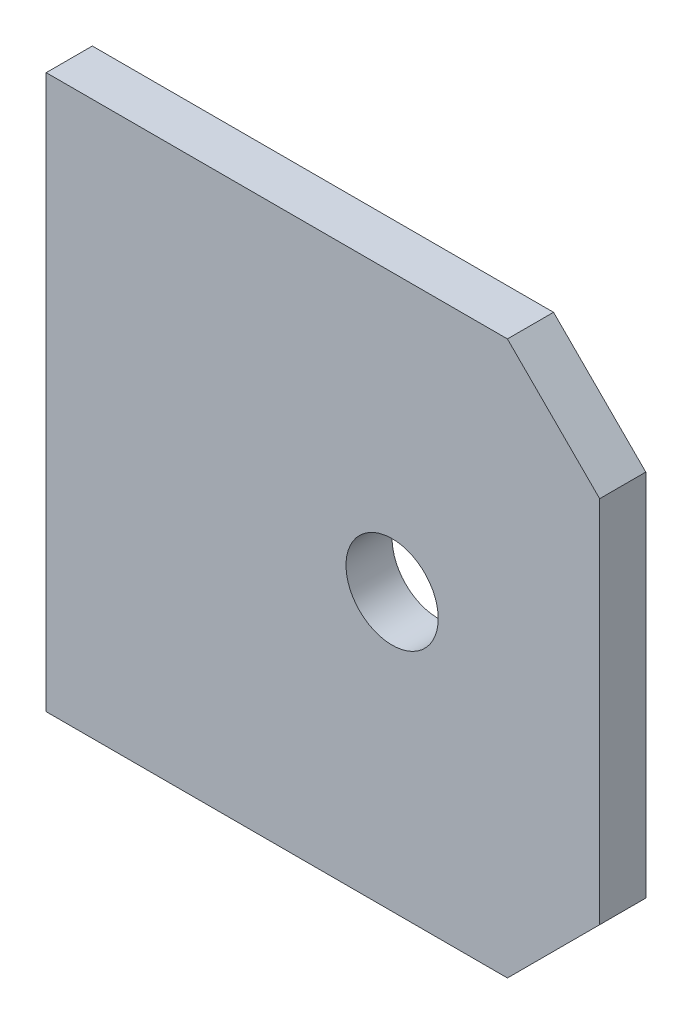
ISO-10303-21;
HEADER;
FILE_DESCRIPTION(('STEP AP214'),'2;1');
FILE_NAME('part.step','',(''),(''),'','','');
FILE_SCHEMA(('AUTOMOTIVE_DESIGN { 1 0 10303 214 1 1 1 1 }'));
ENDSEC;
DATA;
#1=APPLICATION_CONTEXT('core data for automotive mechanical design processes');
#2=APPLICATION_PROTOCOL_DEFINITION('international standard','automotive_design',2000,#1);
#3=PRODUCT_CONTEXT('',#1,'mechanical');
#4=PRODUCT('Part','Part','',(#3));
#5=PRODUCT_RELATED_PRODUCT_CATEGORY('part','',(#4));
#6=PRODUCT_DEFINITION_FORMATION('','',#4);
#7=PRODUCT_DEFINITION_CONTEXT('part definition',#1,'design');
#8=PRODUCT_DEFINITION('design','',#6,#7);
#9=PRODUCT_DEFINITION_SHAPE('','',#8);
#10=(LENGTH_UNIT() NAMED_UNIT(*) SI_UNIT(.MILLI.,.METRE.));
#11=(NAMED_UNIT(*) PLANE_ANGLE_UNIT() SI_UNIT($,.RADIAN.));
#12=(NAMED_UNIT(*) SI_UNIT($,.STERADIAN.) SOLID_ANGLE_UNIT());
#13=UNCERTAINTY_MEASURE_WITH_UNIT(LENGTH_MEASURE(1.E-05),#10,'distance_accuracy_value','');
#14=(GEOMETRIC_REPRESENTATION_CONTEXT(3) GLOBAL_UNCERTAINTY_ASSIGNED_CONTEXT((#13)) GLOBAL_UNIT_ASSIGNED_CONTEXT((#10,
#11,#12)) REPRESENTATION_CONTEXT('',''));
#15=CARTESIAN_POINT('',(0.,0.,0.));
#16=DIRECTION('',(0.,0.,1.));
#17=DIRECTION('',(1.,0.,0.));
#18=AXIS2_PLACEMENT_3D('',#15,#16,#17);
#19=CARTESIAN_POINT('',(0.,-120.,10.));
#20=DIRECTION('',(0.,0.,1.));
#21=DIRECTION('',(1.,0.,0.));
#22=AXIS2_PLACEMENT_3D('',#19,#20,#21);
#23=PLANE('',#22);
#24=DIRECTION('',(0.,-1.,0.));
#25=VECTOR('',#24,1.);
#26=CARTESIAN_POINT('',(0.,0.,10.));
#27=LINE('',#26,#25);
#28=CARTESIAN_POINT('',(0.,0.,10.));
#29=VERTEX_POINT('',#28);
#30=CARTESIAN_POINT('',(0.,-120.,10.));
#31=VERTEX_POINT('',#30);
#32=EDGE_CURVE('E117',#29,#31,#27,.T.);
#33=ORIENTED_EDGE('',*,*,#32,.T.);
#34=DIRECTION('',(1.,0.,0.));
#35=VECTOR('',#34,1.);
#36=CARTESIAN_POINT('',(0.,-120.,10.));
#37=LINE('',#36,#35);
#38=CARTESIAN_POINT('',(100.,-120.,10.));
#39=VERTEX_POINT('',#38);
#40=EDGE_CURVE('E98',#31,#39,#37,.T.);
#41=ORIENTED_EDGE('',*,*,#40,.T.);
#42=DIRECTION('',(0.707106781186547,0.707106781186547,0.));
#43=VECTOR('',#42,1.);
#44=CARTESIAN_POINT('',(120.,-100.,10.));
#45=LINE('',#44,#43);
#46=CARTESIAN_POINT('',(120.,-100.,10.));
#47=VERTEX_POINT('',#46);
#48=EDGE_CURVE('E120',#39,#47,#45,.T.);
#49=ORIENTED_EDGE('',*,*,#48,.T.);
#50=DIRECTION('',(0.,1.,0.));
#51=VECTOR('',#50,1.);
#52=CARTESIAN_POINT('',(120.,-20.,10.));
#53=LINE('',#52,#51);
#54=CARTESIAN_POINT('',(120.,-20.,10.));
#55=VERTEX_POINT('',#54);
#56=EDGE_CURVE('E122',#47,#55,#53,.T.);
#57=ORIENTED_EDGE('',*,*,#56,.T.);
#58=DIRECTION('',(-0.707106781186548,0.707106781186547,0.));
#59=VECTOR('',#58,1.);
#60=CARTESIAN_POINT('',(100.,0.,10.));
#61=LINE('',#60,#59);
#62=CARTESIAN_POINT('',(100.,0.,10.));
#63=VERTEX_POINT('',#62);
#64=EDGE_CURVE('E51',#55,#63,#61,.T.);
#65=ORIENTED_EDGE('',*,*,#64,.T.);
#66=DIRECTION('',(-1.,0.,0.));
#67=VECTOR('',#66,1.);
#68=CARTESIAN_POINT('',(0.,0.,10.));
#69=LINE('',#68,#67);
#70=EDGE_CURVE('E46',#63,#29,#69,.T.);
#71=ORIENTED_EDGE('',*,*,#70,.T.);
#72=EDGE_LOOP('',(#33,#41,#49,#57,#65,#71));
#73=FACE_BOUND('',#72,.T.);
#74=CARTESIAN_POINT('',(75.,-60.,10.));
#75=DIRECTION('',(0.,0.,1.));
#76=DIRECTION('',(1.,0.,0.));
#77=AXIS2_PLACEMENT_3D('',#74,#75,#76);
#78=CIRCLE('',#77,9.99999999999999);
#79=CARTESIAN_POINT('',(85.,-60.,10.));
#80=VERTEX_POINT('',#79);
#81=EDGE_CURVE('E103',#80,#80,#78,.T.);
#82=ORIENTED_EDGE('',*,*,#81,.F.);
#83=EDGE_LOOP('',(#82));
#84=FACE_BOUND('',#83,.T.);
#85=ADVANCED_FACE('F31',(#73,#84),#23,.T.);
#86=CARTESIAN_POINT('',(0.,-120.,0.));
#87=DIRECTION('',(0.,0.,1.));
#88=DIRECTION('',(1.,0.,0.));
#89=AXIS2_PLACEMENT_3D('',#86,#87,#88);
#90=PLANE('',#89);
#91=DIRECTION('',(0.,-1.,0.));
#92=VECTOR('',#91,1.);
#93=CARTESIAN_POINT('',(0.,0.,0.));
#94=LINE('',#93,#92);
#95=CARTESIAN_POINT('',(0.,0.,0.));
#96=VERTEX_POINT('',#95);
#97=CARTESIAN_POINT('',(0.,-120.,0.));
#98=VERTEX_POINT('',#97);
#99=EDGE_CURVE('E89',#96,#98,#94,.T.);
#100=ORIENTED_EDGE('',*,*,#99,.F.);
#101=DIRECTION('',(-1.,0.,0.));
#102=VECTOR('',#101,1.);
#103=CARTESIAN_POINT('',(0.,0.,0.));
#104=LINE('',#103,#102);
#105=CARTESIAN_POINT('',(100.,0.,0.));
#106=VERTEX_POINT('',#105);
#107=EDGE_CURVE('E115',#106,#96,#104,.T.);
#108=ORIENTED_EDGE('',*,*,#107,.F.);
#109=DIRECTION('',(-0.707106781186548,0.707106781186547,0.));
#110=VECTOR('',#109,1.);
#111=CARTESIAN_POINT('',(100.,0.,0.));
#112=LINE('',#111,#110);
#113=CARTESIAN_POINT('',(120.,-20.,0.));
#114=VERTEX_POINT('',#113);
#115=EDGE_CURVE('E113',#114,#106,#112,.T.);
#116=ORIENTED_EDGE('',*,*,#115,.F.);
#117=DIRECTION('',(0.,1.,0.));
#118=VECTOR('',#117,1.);
#119=CARTESIAN_POINT('',(120.,-20.,0.));
#120=LINE('',#119,#118);
#121=CARTESIAN_POINT('',(120.,-100.,0.));
#122=VERTEX_POINT('',#121);
#123=EDGE_CURVE('E111',#122,#114,#120,.T.);
#124=ORIENTED_EDGE('',*,*,#123,.F.);
#125=DIRECTION('',(0.707106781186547,0.707106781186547,0.));
#126=VECTOR('',#125,1.);
#127=CARTESIAN_POINT('',(120.,-100.,0.));
#128=LINE('',#127,#126);
#129=CARTESIAN_POINT('',(100.,-120.,0.));
#130=VERTEX_POINT('',#129);
#131=EDGE_CURVE('E91',#130,#122,#128,.T.);
#132=ORIENTED_EDGE('',*,*,#131,.F.);
#133=DIRECTION('',(1.,0.,0.));
#134=VECTOR('',#133,1.);
#135=CARTESIAN_POINT('',(0.,-120.,0.));
#136=LINE('',#135,#134);
#137=EDGE_CURVE('E84',#98,#130,#136,.T.);
#138=ORIENTED_EDGE('',*,*,#137,.F.);
#139=EDGE_LOOP('',(#100,#108,#116,#124,#132,#138));
#140=FACE_BOUND('',#139,.T.);
#141=CARTESIAN_POINT('',(75.,-60.,0.));
#142=DIRECTION('',(0.,0.,1.));
#143=DIRECTION('',(1.,0.,0.));
#144=AXIS2_PLACEMENT_3D('',#141,#142,#143);
#145=CIRCLE('',#144,9.99999999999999);
#146=CARTESIAN_POINT('',(85.,-60.,0.));
#147=VERTEX_POINT('',#146);
#148=EDGE_CURVE('E106',#147,#147,#145,.T.);
#149=ORIENTED_EDGE('',*,*,#148,.T.);
#150=EDGE_LOOP('',(#149));
#151=FACE_BOUND('',#150,.T.);
#152=ADVANCED_FACE('F85',(#140,#151),#90,.F.);
#153=CARTESIAN_POINT('',(0.,0.,10.));
#154=DIRECTION('',(1.,0.,0.));
#155=DIRECTION('',(0.,1.,0.));
#156=AXIS2_PLACEMENT_3D('',#153,#154,#155);
#157=PLANE('',#156);
#158=ORIENTED_EDGE('',*,*,#99,.T.);
#159=DIRECTION('',(0.,0.,-1.));
#160=VECTOR('',#159,1.);
#161=CARTESIAN_POINT('',(0.,-120.,10.));
#162=LINE('',#161,#160);
#163=EDGE_CURVE('E11',#31,#98,#162,.T.);
#164=ORIENTED_EDGE('',*,*,#163,.F.);
#165=ORIENTED_EDGE('',*,*,#32,.F.);
#166=DIRECTION('',(0.,0.,-1.));
#167=VECTOR('',#166,1.);
#168=CARTESIAN_POINT('',(0.,0.,10.));
#169=LINE('',#168,#167);
#170=EDGE_CURVE('E102',#29,#96,#169,.T.);
#171=ORIENTED_EDGE('',*,*,#170,.T.);
#172=EDGE_LOOP('',(#158,#164,#165,#171));
#173=FACE_BOUND('',#172,.T.);
#174=ADVANCED_FACE('F33',(#173),#157,.F.);
#175=CARTESIAN_POINT('',(0.,-120.,10.));
#176=DIRECTION('',(0.,1.,0.));
#177=DIRECTION('',(-1.,0.,0.));
#178=AXIS2_PLACEMENT_3D('',#175,#176,#177);
#179=PLANE('',#178);
#180=ORIENTED_EDGE('',*,*,#137,.T.);
#181=DIRECTION('',(0.,0.,-1.));
#182=VECTOR('',#181,1.);
#183=CARTESIAN_POINT('',(100.,-120.,10.));
#184=LINE('',#183,#182);
#185=EDGE_CURVE('E39',#39,#130,#184,.T.);
#186=ORIENTED_EDGE('',*,*,#185,.F.);
#187=ORIENTED_EDGE('',*,*,#40,.F.);
#188=ORIENTED_EDGE('',*,*,#163,.T.);
#189=EDGE_LOOP('',(#180,#186,#187,#188));
#190=FACE_BOUND('',#189,.T.);
#191=ADVANCED_FACE('F97',(#190),#179,.F.);
#192=CARTESIAN_POINT('',(120.,-100.,10.));
#193=DIRECTION('',(-0.707106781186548,0.707106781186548,0.));
#194=DIRECTION('',(-0.707106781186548,-0.707106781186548,0.));
#195=AXIS2_PLACEMENT_3D('',#192,#193,#194);
#196=PLANE('',#195);
#197=ORIENTED_EDGE('',*,*,#131,.T.);
#198=DIRECTION('',(0.,0.,-1.));
#199=VECTOR('',#198,1.);
#200=CARTESIAN_POINT('',(120.,-100.,10.));
#201=LINE('',#200,#199);
#202=EDGE_CURVE('E133',#47,#122,#201,.T.);
#203=ORIENTED_EDGE('',*,*,#202,.F.);
#204=ORIENTED_EDGE('',*,*,#48,.F.);
#205=ORIENTED_EDGE('',*,*,#185,.T.);
#206=EDGE_LOOP('',(#197,#203,#204,#205));
#207=FACE_BOUND('',#206,.T.);
#208=ADVANCED_FACE('F137',(#207),#196,.F.);
#209=CARTESIAN_POINT('',(120.,-20.,10.));
#210=DIRECTION('',(-1.,0.,0.));
#211=DIRECTION('',(0.,0.,1.));
#212=AXIS2_PLACEMENT_3D('',#209,#210,#211);
#213=PLANE('',#212);
#214=ORIENTED_EDGE('',*,*,#123,.T.);
#215=DIRECTION('',(0.,0.,-1.));
#216=VECTOR('',#215,1.);
#217=CARTESIAN_POINT('',(120.,-20.,10.));
#218=LINE('',#217,#216);
#219=EDGE_CURVE('E130',#55,#114,#218,.T.);
#220=ORIENTED_EDGE('',*,*,#219,.F.);
#221=ORIENTED_EDGE('',*,*,#56,.F.);
#222=ORIENTED_EDGE('',*,*,#202,.T.);
#223=EDGE_LOOP('',(#214,#220,#221,#222));
#224=FACE_BOUND('',#223,.T.);
#225=ADVANCED_FACE('F143',(#224),#213,.F.);
#226=CARTESIAN_POINT('',(100.,0.,10.));
#227=DIRECTION('',(-0.707106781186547,-0.707106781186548,0.));
#228=DIRECTION('',(0.707106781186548,-0.707106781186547,0.));
#229=AXIS2_PLACEMENT_3D('',#226,#227,#228);
#230=PLANE('',#229);
#231=ORIENTED_EDGE('',*,*,#115,.T.);
#232=DIRECTION('',(0.,0.,-1.));
#233=VECTOR('',#232,1.);
#234=CARTESIAN_POINT('',(100.,0.,10.));
#235=LINE('',#234,#233);
#236=EDGE_CURVE('E127',#63,#106,#235,.T.);
#237=ORIENTED_EDGE('',*,*,#236,.F.);
#238=ORIENTED_EDGE('',*,*,#64,.F.);
#239=ORIENTED_EDGE('',*,*,#219,.T.);
#240=EDGE_LOOP('',(#231,#237,#238,#239));
#241=FACE_BOUND('',#240,.T.);
#242=ADVANCED_FACE('F146',(#241),#230,.F.);
#243=CARTESIAN_POINT('',(0.,0.,10.));
#244=DIRECTION('',(0.,-1.,0.));
#245=DIRECTION('',(0.,0.,-1.));
#246=AXIS2_PLACEMENT_3D('',#243,#244,#245);
#247=PLANE('',#246);
#248=ORIENTED_EDGE('',*,*,#107,.T.);
#249=ORIENTED_EDGE('',*,*,#170,.F.);
#250=ORIENTED_EDGE('',*,*,#70,.F.);
#251=ORIENTED_EDGE('',*,*,#236,.T.);
#252=EDGE_LOOP('',(#248,#249,#250,#251));
#253=FACE_BOUND('',#252,.T.);
#254=ADVANCED_FACE('F148',(#253),#247,.F.);
#255=CARTESIAN_POINT('',(75.,-60.,10.));
#256=DIRECTION('',(0.,0.,-1.));
#257=DIRECTION('',(-1.,0.,0.));
#258=AXIS2_PLACEMENT_3D('',#255,#256,#257);
#259=CYLINDRICAL_SURFACE('',#258,9.99999999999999);
#260=ORIENTED_EDGE('',*,*,#81,.T.);
#261=EDGE_LOOP('',(#260));
#262=FACE_BOUND('',#261,.T.);
#263=ORIENTED_EDGE('',*,*,#148,.F.);
#264=EDGE_LOOP('',(#263));
#265=FACE_BOUND('',#264,.T.);
#266=ADVANCED_FACE('F150',(#262,#265),#259,.F.);
#267=CLOSED_SHELL('',(#85,#152,#174,#191,#208,#225,#242,#254,#266));
#268=MANIFOLD_SOLID_BREP('B2',#267);
#269=ADVANCED_BREP_SHAPE_REPRESENTATION('',(#18,#268),#14);
#270=SHAPE_DEFINITION_REPRESENTATION(#9,#269);
ENDSEC;
END-ISO-10303-21;
